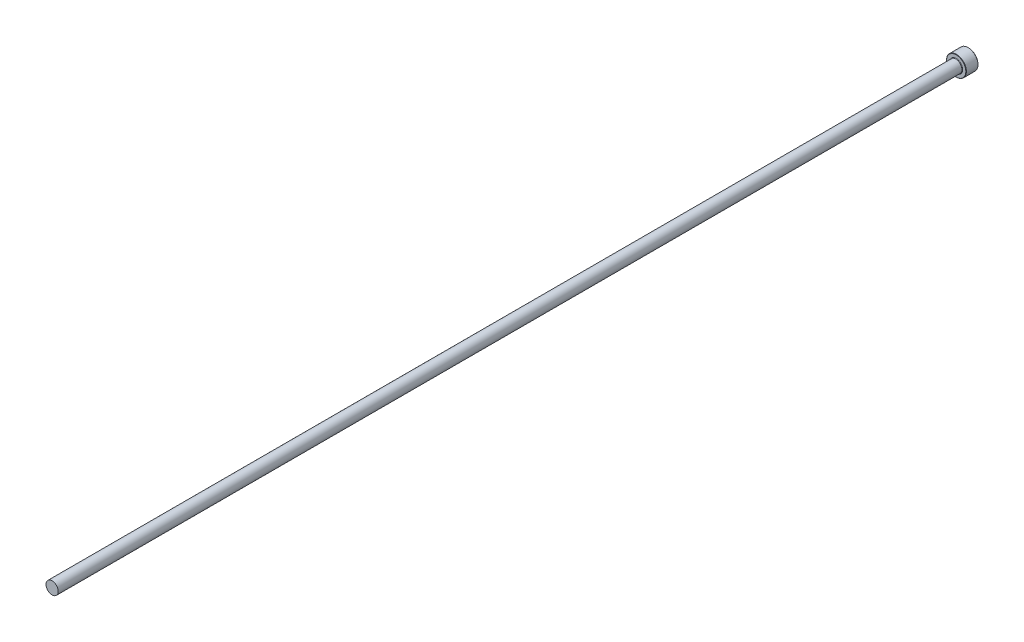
ISO-10303-21;
HEADER;
FILE_DESCRIPTION(('STEP AP214'),'2;1');
FILE_NAME('part.step','',(''),(''),'','','');
FILE_SCHEMA(('AUTOMOTIVE_DESIGN { 1 0 10303 214 1 1 1 1 }'));
ENDSEC;
DATA;
#1=APPLICATION_CONTEXT('core data for automotive mechanical design processes');
#2=APPLICATION_PROTOCOL_DEFINITION('international standard','automotive_design',2000,#1);
#3=PRODUCT_CONTEXT('',#1,'mechanical');
#4=PRODUCT('Part','Part','',(#3));
#5=PRODUCT_RELATED_PRODUCT_CATEGORY('part','',(#4));
#6=PRODUCT_DEFINITION_FORMATION('','',#4);
#7=PRODUCT_DEFINITION_CONTEXT('part definition',#1,'design');
#8=PRODUCT_DEFINITION('design','',#6,#7);
#9=PRODUCT_DEFINITION_SHAPE('','',#8);
#10=(LENGTH_UNIT() NAMED_UNIT(*) SI_UNIT(.MILLI.,.METRE.));
#11=(NAMED_UNIT(*) PLANE_ANGLE_UNIT() SI_UNIT($,.RADIAN.));
#12=(NAMED_UNIT(*) SI_UNIT($,.STERADIAN.) SOLID_ANGLE_UNIT());
#13=UNCERTAINTY_MEASURE_WITH_UNIT(LENGTH_MEASURE(1.E-05),#10,'distance_accuracy_value','');
#14=(GEOMETRIC_REPRESENTATION_CONTEXT(3) GLOBAL_UNCERTAINTY_ASSIGNED_CONTEXT((#13)) GLOBAL_UNIT_ASSIGNED_CONTEXT((#10,
#11,#12)) REPRESENTATION_CONTEXT('',''));
#15=CARTESIAN_POINT('',(0.,0.,0.));
#16=DIRECTION('',(0.,0.,1.));
#17=DIRECTION('',(1.,0.,0.));
#18=AXIS2_PLACEMENT_3D('',#15,#16,#17);
#19=CARTESIAN_POINT('',(0.,3.99999999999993,600.));
#20=DIRECTION('',(0.,0.,-1.));
#21=DIRECTION('',(-1.,0.,0.));
#22=AXIS2_PLACEMENT_3D('',#19,#20,#21);
#23=PLANE('',#22);
#24=CARTESIAN_POINT('',(0.,0.,600.));
#25=DIRECTION('',(0.,0.,1.));
#26=DIRECTION('',(1.,0.,0.));
#27=AXIS2_PLACEMENT_3D('',#24,#25,#26);
#28=CIRCLE('',#27,3.99999999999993);
#29=CARTESIAN_POINT('',(3.99999999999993,0.,600.));
#30=VERTEX_POINT('',#29);
#31=EDGE_CURVE('E50',#30,#30,#28,.T.);
#32=ORIENTED_EDGE('',*,*,#31,.T.);
#33=EDGE_LOOP('',(#32));
#34=FACE_BOUND('',#33,.T.);
#35=ADVANCED_FACE('F30',(#34),#23,.F.);
#36=CARTESIAN_POINT('',(0.,0.,109.050628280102));
#37=DIRECTION('',(0.,0.,1.));
#38=DIRECTION('',(1.,0.,0.));
#39=AXIS2_PLACEMENT_3D('',#36,#37,#38);
#40=CYLINDRICAL_SURFACE('',#39,3.99999999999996);
#41=ORIENTED_EDGE('',*,*,#31,.F.);
#42=EDGE_LOOP('',(#41));
#43=FACE_BOUND('',#42,.T.);
#44=CARTESIAN_POINT('',(0.,0.,8.3));
#45=DIRECTION('',(0.,0.,1.));
#46=DIRECTION('',(1.,0.,0.));
#47=AXIS2_PLACEMENT_3D('',#44,#45,#46);
#48=CIRCLE('',#47,4.);
#49=CARTESIAN_POINT('',(4.,0.,8.3));
#50=VERTEX_POINT('',#49);
#51=EDGE_CURVE('E53',#50,#50,#48,.T.);
#52=ORIENTED_EDGE('',*,*,#51,.T.);
#53=EDGE_LOOP('',(#52));
#54=FACE_BOUND('',#53,.T.);
#55=ADVANCED_FACE('F73',(#43,#54),#40,.T.);
#56=CARTESIAN_POINT('',(0.,0.,8.3));
#57=DIRECTION('',(0.,0.,1.));
#58=DIRECTION('',(1.,0.,0.));
#59=AXIS2_PLACEMENT_3D('',#56,#57,#58);
#60=TOROIDAL_SURFACE('',#59,4.3,0.3);
#61=ORIENTED_EDGE('',*,*,#51,.F.);
#62=EDGE_LOOP('',(#61));
#63=FACE_BOUND('',#62,.T.);
#64=CARTESIAN_POINT('',(0.,0.,8.00000000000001));
#65=DIRECTION('',(0.,0.,1.));
#66=DIRECTION('',(1.,0.,0.));
#67=AXIS2_PLACEMENT_3D('',#64,#65,#66);
#68=CIRCLE('',#67,4.3);
#69=CARTESIAN_POINT('',(4.3,0.,8.00000000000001));
#70=VERTEX_POINT('',#69);
#71=EDGE_CURVE('E56',#70,#70,#68,.T.);
#72=ORIENTED_EDGE('',*,*,#71,.T.);
#73=EDGE_LOOP('',(#72));
#74=FACE_BOUND('',#73,.T.);
#75=ADVANCED_FACE('F60',(#63,#74),#60,.F.);
#76=CARTESIAN_POINT('',(0.,6.5,8.));
#77=DIRECTION('',(0.,0.,-1.));
#78=DIRECTION('',(-1.,0.,0.));
#79=AXIS2_PLACEMENT_3D('',#76,#77,#78);
#80=PLANE('',#79);
#81=CARTESIAN_POINT('',(0.,0.,8.));
#82=DIRECTION('',(0.,0.,-1.));
#83=DIRECTION('',(-1.,0.,0.));
#84=AXIS2_PLACEMENT_3D('',#81,#82,#83);
#85=CIRCLE('',#84,6.30000000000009);
#86=CARTESIAN_POINT('',(-6.30000000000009,0.,8.));
#87=VERTEX_POINT('',#86);
#88=EDGE_CURVE('E10',#87,#87,#85,.F.);
#89=ORIENTED_EDGE('',*,*,#88,.T.);
#90=EDGE_LOOP('',(#89));
#91=FACE_BOUND('',#90,.T.);
#92=ORIENTED_EDGE('',*,*,#71,.F.);
#93=EDGE_LOOP('',(#92));
#94=FACE_BOUND('',#93,.T.);
#95=ADVANCED_FACE('F62',(#91,#94),#80,.F.);
#96=CARTESIAN_POINT('',(0.,0.,109.050628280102));
#97=DIRECTION('',(0.,0.,1.));
#98=DIRECTION('',(1.,0.,0.));
#99=AXIS2_PLACEMENT_3D('',#96,#97,#98);
#100=CYLINDRICAL_SURFACE('',#99,6.5);
#101=CARTESIAN_POINT('',(0.,0.,0.199999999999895));
#102=DIRECTION('',(0.,0.,1.));
#103=DIRECTION('',(1.,0.,0.));
#104=AXIS2_PLACEMENT_3D('',#101,#102,#103);
#105=CIRCLE('',#104,6.5);
#106=CARTESIAN_POINT('',(6.5,0.,0.199999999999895));
#107=VERTEX_POINT('',#106);
#108=EDGE_CURVE('E41',#107,#107,#105,.T.);
#109=ORIENTED_EDGE('',*,*,#108,.T.);
#110=EDGE_LOOP('',(#109));
#111=FACE_BOUND('',#110,.T.);
#112=CARTESIAN_POINT('',(0.,0.,7.8000000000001));
#113=DIRECTION('',(0.,0.,-1.));
#114=DIRECTION('',(-1.,0.,0.));
#115=AXIS2_PLACEMENT_3D('',#112,#113,#114);
#116=CIRCLE('',#115,6.5);
#117=CARTESIAN_POINT('',(-6.5,0.,7.8000000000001));
#118=VERTEX_POINT('',#117);
#119=EDGE_CURVE('E45',#118,#118,#116,.T.);
#120=ORIENTED_EDGE('',*,*,#119,.T.);
#121=EDGE_LOOP('',(#120));
#122=FACE_BOUND('',#121,.T.);
#123=ADVANCED_FACE('F64',(#111,#122),#100,.T.);
#124=CARTESIAN_POINT('',(0.,0.,0.));
#125=DIRECTION('',(0.,0.,1.));
#126=DIRECTION('',(1.,0.,0.));
#127=AXIS2_PLACEMENT_3D('',#124,#125,#126);
#128=PLANE('',#127);
#129=CARTESIAN_POINT('',(0.,0.,0.));
#130=DIRECTION('',(0.,0.,1.));
#131=DIRECTION('',(1.,0.,0.));
#132=AXIS2_PLACEMENT_3D('',#129,#130,#131);
#133=CIRCLE('',#132,6.30000000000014);
#134=CARTESIAN_POINT('',(6.30000000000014,0.,0.));
#135=VERTEX_POINT('',#134);
#136=EDGE_CURVE('E37',#135,#135,#133,.F.);
#137=ORIENTED_EDGE('',*,*,#136,.T.);
#138=EDGE_LOOP('',(#137));
#139=FACE_BOUND('',#138,.T.);
#140=ADVANCED_FACE('F70',(#139),#128,.F.);
#141=CARTESIAN_POINT('',(0.,0.,0.199999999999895));
#142=DIRECTION('',(0.,0.,1.));
#143=DIRECTION('',(1.,0.,0.));
#144=AXIS2_PLACEMENT_3D('',#141,#142,#143);
#145=CONICAL_SURFACE('',#144,6.5,0.785398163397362);
#146=ORIENTED_EDGE('',*,*,#136,.F.);
#147=EDGE_LOOP('',(#146));
#148=FACE_BOUND('',#147,.T.);
#149=ORIENTED_EDGE('',*,*,#108,.F.);
#150=EDGE_LOOP('',(#149));
#151=FACE_BOUND('',#150,.T.);
#152=ADVANCED_FACE('F84',(#148,#151),#145,.T.);
#153=CARTESIAN_POINT('',(0.,0.,8.00000000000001));
#154=DIRECTION('',(0.,0.,-1.));
#155=DIRECTION('',(-1.,0.,0.));
#156=AXIS2_PLACEMENT_3D('',#153,#154,#155);
#157=CONICAL_SURFACE('',#156,6.30000000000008,0.785398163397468);
#158=ORIENTED_EDGE('',*,*,#119,.F.);
#159=EDGE_LOOP('',(#158));
#160=FACE_BOUND('',#159,.T.);
#161=ORIENTED_EDGE('',*,*,#88,.F.);
#162=EDGE_LOOP('',(#161));
#163=FACE_BOUND('',#162,.T.);
#164=ADVANCED_FACE('F32',(#160,#163),#157,.T.);
#165=CLOSED_SHELL('',(#35,#55,#75,#95,#123,#140,#152,#164));
#166=MANIFOLD_SOLID_BREP('B2',#165);
#167=ADVANCED_BREP_SHAPE_REPRESENTATION('',(#18,#166),#14);
#168=SHAPE_DEFINITION_REPRESENTATION(#9,#167);
ENDSEC;
END-ISO-10303-21;
